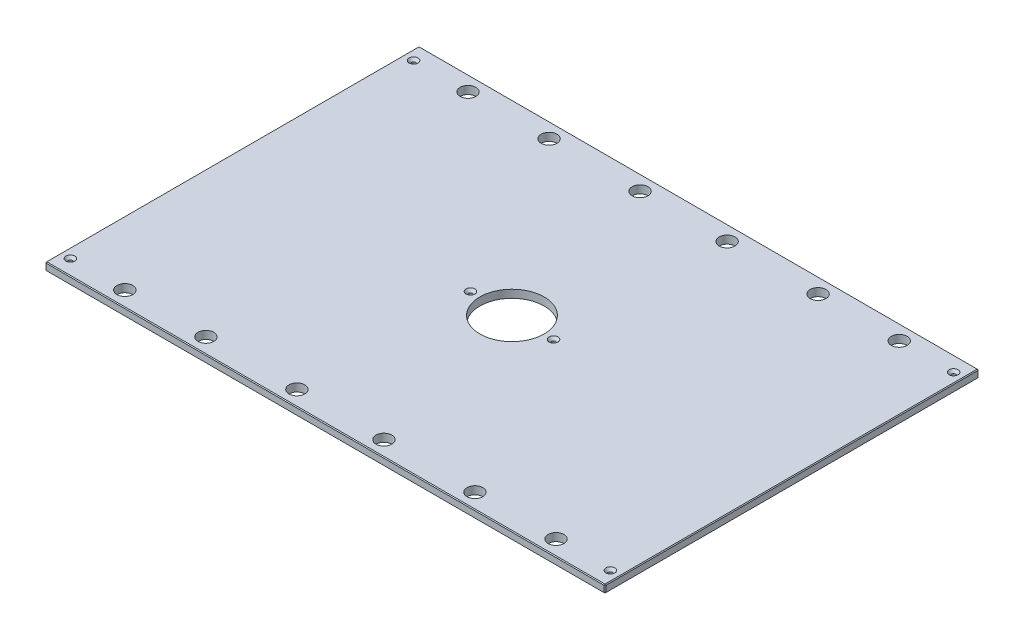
ISO-10303-21;
HEADER;
FILE_DESCRIPTION(('STEP AP214'),'2;1');
FILE_NAME('part.step','',(''),(''),'','','');
FILE_SCHEMA(('AUTOMOTIVE_DESIGN { 1 0 10303 214 1 1 1 1 }'));
ENDSEC;
DATA;
#1=APPLICATION_CONTEXT('core data for automotive mechanical design processes');
#2=APPLICATION_PROTOCOL_DEFINITION('international standard','automotive_design',2000,#1);
#3=PRODUCT_CONTEXT('',#1,'mechanical');
#4=PRODUCT('Part','Part','',(#3));
#5=PRODUCT_RELATED_PRODUCT_CATEGORY('part','',(#4));
#6=PRODUCT_DEFINITION_FORMATION('','',#4);
#7=PRODUCT_DEFINITION_CONTEXT('part definition',#1,'design');
#8=PRODUCT_DEFINITION('design','',#6,#7);
#9=PRODUCT_DEFINITION_SHAPE('','',#8);
#10=(LENGTH_UNIT() NAMED_UNIT(*) SI_UNIT(.MILLI.,.METRE.));
#11=(NAMED_UNIT(*) PLANE_ANGLE_UNIT() SI_UNIT($,.RADIAN.));
#12=(NAMED_UNIT(*) SI_UNIT($,.STERADIAN.) SOLID_ANGLE_UNIT());
#13=UNCERTAINTY_MEASURE_WITH_UNIT(LENGTH_MEASURE(1.E-05),#10,'distance_accuracy_value','');
#14=(GEOMETRIC_REPRESENTATION_CONTEXT(3) GLOBAL_UNCERTAINTY_ASSIGNED_CONTEXT((#13)) GLOBAL_UNIT_ASSIGNED_CONTEXT((#10,
#11,#12)) REPRESENTATION_CONTEXT('',''));
#15=CARTESIAN_POINT('',(0.,0.,0.));
#16=DIRECTION('',(0.,0.,1.));
#17=DIRECTION('',(1.,0.,0.));
#18=AXIS2_PLACEMENT_3D('',#15,#16,#17);
#19=CARTESIAN_POINT('',(-449.2625,12.7,-300.0375));
#20=DIRECTION('',(1.,0.,0.));
#21=DIRECTION('',(0.,0.,-1.));
#22=AXIS2_PLACEMENT_3D('',#19,#20,#21);
#23=PLANE('',#22);
#24=DIRECTION('',(0.,0.,-1.));
#25=VECTOR('',#24,1.);
#26=CARTESIAN_POINT('',(-449.2625,11.43,-300.0375));
#27=LINE('',#26,#25);
#28=CARTESIAN_POINT('',(-449.2625,11.43,298.7675));
#29=VERTEX_POINT('',#28);
#30=CARTESIAN_POINT('',(-449.2625,11.43,-298.7675));
#31=VERTEX_POINT('',#30);
#32=EDGE_CURVE('E136',#29,#31,#27,.T.);
#33=ORIENTED_EDGE('',*,*,#32,.T.);
#34=DIRECTION('',(0.,-1.,0.));
#35=VECTOR('',#34,1.);
#36=CARTESIAN_POINT('',(-449.2625,12.7,-298.7675));
#37=LINE('',#36,#35);
#38=CARTESIAN_POINT('',(-449.2625,1.26999999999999,-298.7675));
#39=VERTEX_POINT('',#38);
#40=EDGE_CURVE('E132',#31,#39,#37,.T.);
#41=ORIENTED_EDGE('',*,*,#40,.T.);
#42=DIRECTION('',(0.,0.,1.));
#43=VECTOR('',#42,1.);
#44=CARTESIAN_POINT('',(-449.2625,1.26999999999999,-300.0375));
#45=LINE('',#44,#43);
#46=CARTESIAN_POINT('',(-449.2625,1.26999999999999,298.7675));
#47=VERTEX_POINT('',#46);
#48=EDGE_CURVE('E127',#39,#47,#45,.T.);
#49=ORIENTED_EDGE('',*,*,#48,.T.);
#50=DIRECTION('',(0.,1.,0.));
#51=VECTOR('',#50,1.);
#52=CARTESIAN_POINT('',(-449.2625,12.7,298.7675));
#53=LINE('',#52,#51);
#54=EDGE_CURVE('E129',#47,#29,#53,.T.);
#55=ORIENTED_EDGE('',*,*,#54,.T.);
#56=EDGE_LOOP('',(#33,#41,#49,#55));
#57=FACE_BOUND('',#56,.T.);
#58=ADVANCED_FACE('F36',(#57),#23,.F.);
#59=CARTESIAN_POINT('',(-449.2625,12.7,300.0375));
#60=DIRECTION('',(0.,0.,-1.));
#61=DIRECTION('',(-1.,0.,0.));
#62=AXIS2_PLACEMENT_3D('',#59,#60,#61);
#63=PLANE('',#62);
#64=DIRECTION('',(1.,0.,0.));
#65=VECTOR('',#64,1.);
#66=CARTESIAN_POINT('',(-449.2625,1.26999999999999,300.0375));
#67=LINE('',#66,#65);
#68=CARTESIAN_POINT('',(-447.9925,1.26999999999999,300.0375));
#69=VERTEX_POINT('',#68);
#70=CARTESIAN_POINT('',(447.9925,1.26999999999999,300.0375));
#71=VERTEX_POINT('',#70);
#72=EDGE_CURVE('E59',#69,#71,#67,.T.);
#73=ORIENTED_EDGE('',*,*,#72,.T.);
#74=DIRECTION('',(0.,1.,0.));
#75=VECTOR('',#74,1.);
#76=CARTESIAN_POINT('',(447.9925,12.7,300.0375));
#77=LINE('',#76,#75);
#78=CARTESIAN_POINT('',(447.9925,11.43,300.0375));
#79=VERTEX_POINT('',#78);
#80=EDGE_CURVE('E11',#71,#79,#77,.T.);
#81=ORIENTED_EDGE('',*,*,#80,.T.);
#82=DIRECTION('',(-1.,0.,0.));
#83=VECTOR('',#82,1.);
#84=CARTESIAN_POINT('',(-449.2625,11.43,300.0375));
#85=LINE('',#84,#83);
#86=CARTESIAN_POINT('',(-447.9925,11.43,300.0375));
#87=VERTEX_POINT('',#86);
#88=EDGE_CURVE('E45',#79,#87,#85,.T.);
#89=ORIENTED_EDGE('',*,*,#88,.T.);
#90=DIRECTION('',(0.,-1.,0.));
#91=VECTOR('',#90,1.);
#92=CARTESIAN_POINT('',(-447.9925,12.7,300.0375));
#93=LINE('',#92,#91);
#94=EDGE_CURVE('E328',#87,#69,#93,.T.);
#95=ORIENTED_EDGE('',*,*,#94,.T.);
#96=EDGE_LOOP('',(#73,#81,#89,#95));
#97=FACE_BOUND('',#96,.T.);
#98=ADVANCED_FACE('F397',(#97),#63,.F.);
#99=CARTESIAN_POINT('',(449.2625,12.7,-300.0375));
#100=DIRECTION('',(-1.,0.,0.));
#101=DIRECTION('',(0.,0.,1.));
#102=AXIS2_PLACEMENT_3D('',#99,#100,#101);
#103=PLANE('',#102);
#104=DIRECTION('',(0.,0.,-1.));
#105=VECTOR('',#104,1.);
#106=CARTESIAN_POINT('',(449.2625,1.26999999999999,-300.0375));
#107=LINE('',#106,#105);
#108=CARTESIAN_POINT('',(449.2625,1.26999999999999,298.7675));
#109=VERTEX_POINT('',#108);
#110=CARTESIAN_POINT('',(449.2625,1.26999999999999,-298.7675));
#111=VERTEX_POINT('',#110);
#112=EDGE_CURVE('E323',#109,#111,#107,.T.);
#113=ORIENTED_EDGE('',*,*,#112,.T.);
#114=DIRECTION('',(0.,1.,0.));
#115=VECTOR('',#114,1.);
#116=CARTESIAN_POINT('',(449.2625,12.7,-298.7675));
#117=LINE('',#116,#115);
#118=CARTESIAN_POINT('',(449.2625,11.43,-298.7675));
#119=VERTEX_POINT('',#118);
#120=EDGE_CURVE('E325',#111,#119,#117,.T.);
#121=ORIENTED_EDGE('',*,*,#120,.T.);
#122=DIRECTION('',(0.,0.,1.));
#123=VECTOR('',#122,1.);
#124=CARTESIAN_POINT('',(449.2625,11.43,300.0375));
#125=LINE('',#124,#123);
#126=CARTESIAN_POINT('',(449.2625,11.43,298.7675));
#127=VERTEX_POINT('',#126);
#128=EDGE_CURVE('E321',#119,#127,#125,.T.);
#129=ORIENTED_EDGE('',*,*,#128,.T.);
#130=DIRECTION('',(0.,-1.,0.));
#131=VECTOR('',#130,1.);
#132=CARTESIAN_POINT('',(449.2625,12.7,298.7675));
#133=LINE('',#132,#131);
#134=EDGE_CURVE('E319',#127,#109,#133,.T.);
#135=ORIENTED_EDGE('',*,*,#134,.T.);
#136=EDGE_LOOP('',(#113,#121,#129,#135));
#137=FACE_BOUND('',#136,.T.);
#138=ADVANCED_FACE('F384',(#137),#103,.F.);
#139=CARTESIAN_POINT('',(-449.2625,12.7,-300.0375));
#140=DIRECTION('',(0.,0.,1.));
#141=DIRECTION('',(1.,0.,0.));
#142=AXIS2_PLACEMENT_3D('',#139,#140,#141);
#143=PLANE('',#142);
#144=DIRECTION('',(-1.,0.,0.));
#145=VECTOR('',#144,1.);
#146=CARTESIAN_POINT('',(-449.2625,1.26999999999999,-300.0375));
#147=LINE('',#146,#145);
#148=CARTESIAN_POINT('',(447.9925,1.26999999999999,-300.0375));
#149=VERTEX_POINT('',#148);
#150=CARTESIAN_POINT('',(-447.9925,1.26999999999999,-300.0375));
#151=VERTEX_POINT('',#150);
#152=EDGE_CURVE('E295',#149,#151,#147,.T.);
#153=ORIENTED_EDGE('',*,*,#152,.T.);
#154=DIRECTION('',(0.,1.,0.));
#155=VECTOR('',#154,1.);
#156=CARTESIAN_POINT('',(-447.9925,12.7,-300.0375));
#157=LINE('',#156,#155);
#158=CARTESIAN_POINT('',(-447.9925,11.43,-300.0375));
#159=VERTEX_POINT('',#158);
#160=EDGE_CURVE('E299',#151,#159,#157,.T.);
#161=ORIENTED_EDGE('',*,*,#160,.T.);
#162=DIRECTION('',(1.,0.,0.));
#163=VECTOR('',#162,1.);
#164=CARTESIAN_POINT('',(449.2625,11.43,-300.0375));
#165=LINE('',#164,#163);
#166=CARTESIAN_POINT('',(447.9925,11.43,-300.0375));
#167=VERTEX_POINT('',#166);
#168=EDGE_CURVE('E297',#159,#167,#165,.T.);
#169=ORIENTED_EDGE('',*,*,#168,.T.);
#170=DIRECTION('',(0.,-1.,0.));
#171=VECTOR('',#170,1.);
#172=CARTESIAN_POINT('',(447.9925,12.7,-300.0375));
#173=LINE('',#172,#171);
#174=EDGE_CURVE('E293',#167,#149,#173,.T.);
#175=ORIENTED_EDGE('',*,*,#174,.T.);
#176=EDGE_LOOP('',(#153,#161,#169,#175));
#177=FACE_BOUND('',#176,.T.);
#178=ADVANCED_FACE('F358',(#177),#143,.F.);
#179=CARTESIAN_POINT('',(0.,12.7,0.));
#180=DIRECTION('',(0.,1.,0.));
#181=DIRECTION('',(0.,0.,1.));
#182=AXIS2_PLACEMENT_3D('',#179,#180,#181);
#183=PLANE('',#182);
#184=CARTESIAN_POINT('',(433.3875,12.7,-275.42998));
#185=DIRECTION('',(0.,1.,0.));
#186=DIRECTION('',(0.,0.,1.));
#187=AXIS2_PLACEMENT_3D('',#184,#185,#186);
#188=CIRCLE('',#187,7.13740000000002);
#189=CARTESIAN_POINT('',(433.3875,12.7,-268.29258));
#190=VERTEX_POINT('',#189);
#191=EDGE_CURVE('E881',#190,#190,#188,.T.);
#192=ORIENTED_EDGE('',*,*,#191,.F.);
#193=EDGE_LOOP('',(#192));
#194=FACE_BOUND('',#193,.T.);
#195=CARTESIAN_POINT('',(433.3875,12.7,275.42998));
#196=DIRECTION('',(0.,1.,0.));
#197=DIRECTION('',(0.,0.,1.));
#198=AXIS2_PLACEMENT_3D('',#195,#196,#197);
#199=CIRCLE('',#198,7.13740000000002);
#200=CARTESIAN_POINT('',(433.3875,12.7,282.56738));
#201=VERTEX_POINT('',#200);
#202=EDGE_CURVE('E885',#201,#201,#199,.T.);
#203=ORIENTED_EDGE('',*,*,#202,.F.);
#204=EDGE_LOOP('',(#203));
#205=FACE_BOUND('',#204,.T.);
#206=CARTESIAN_POINT('',(-433.3875,12.7,275.42998));
#207=DIRECTION('',(0.,1.,0.));
#208=DIRECTION('',(0.,0.,1.));
#209=AXIS2_PLACEMENT_3D('',#206,#207,#208);
#210=CIRCLE('',#209,7.13740000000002);
#211=CARTESIAN_POINT('',(-433.3875,12.7,282.56738));
#212=VERTEX_POINT('',#211);
#213=EDGE_CURVE('E889',#212,#212,#210,.T.);
#214=ORIENTED_EDGE('',*,*,#213,.F.);
#215=EDGE_LOOP('',(#214));
#216=FACE_BOUND('',#215,.T.);
#217=CARTESIAN_POINT('',(-66.675,12.7,0.));
#218=DIRECTION('',(0.,1.,0.));
#219=DIRECTION('',(0.,0.,1.));
#220=AXIS2_PLACEMENT_3D('',#217,#218,#219);
#221=CIRCLE('',#220,7.1374);
#222=CARTESIAN_POINT('',(-66.675,12.7,7.1374));
#223=VERTEX_POINT('',#222);
#224=EDGE_CURVE('E893',#223,#223,#221,.T.);
#225=ORIENTED_EDGE('',*,*,#224,.F.);
#226=EDGE_LOOP('',(#225));
#227=FACE_BOUND('',#226,.T.);
#228=CARTESIAN_POINT('',(66.675,12.7,0.));
#229=DIRECTION('',(0.,1.,0.));
#230=DIRECTION('',(0.,0.,1.));
#231=AXIS2_PLACEMENT_3D('',#228,#229,#230);
#232=CIRCLE('',#231,7.1374);
#233=CARTESIAN_POINT('',(66.675,12.7,7.1374));
#234=VERTEX_POINT('',#233);
#235=EDGE_CURVE('E897',#234,#234,#232,.T.);
#236=ORIENTED_EDGE('',*,*,#235,.F.);
#237=EDGE_LOOP('',(#236));
#238=FACE_BOUND('',#237,.T.);
#239=CARTESIAN_POINT('',(-433.3875,12.7,-275.42998));
#240=DIRECTION('',(0.,1.,0.));
#241=DIRECTION('',(0.,0.,1.));
#242=AXIS2_PLACEMENT_3D('',#239,#240,#241);
#243=CIRCLE('',#242,7.13740000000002);
#244=CARTESIAN_POINT('',(-433.3875,12.7,-268.29258));
#245=VERTEX_POINT('',#244);
#246=EDGE_CURVE('E900',#245,#245,#243,.T.);
#247=ORIENTED_EDGE('',*,*,#246,.F.);
#248=EDGE_LOOP('',(#247));
#249=FACE_BOUND('',#248,.T.);
#250=DIRECTION('',(0.,0.,-1.));
#251=VECTOR('',#250,1.);
#252=CARTESIAN_POINT('',(447.9925,12.7,-300.0375));
#253=LINE('',#252,#251);
#254=CARTESIAN_POINT('',(447.9925,12.7,298.7675));
#255=VERTEX_POINT('',#254);
#256=CARTESIAN_POINT('',(447.9925,12.7,-298.7675));
#257=VERTEX_POINT('',#256);
#258=EDGE_CURVE('E306',#255,#257,#253,.T.);
#259=ORIENTED_EDGE('',*,*,#258,.T.);
#260=DIRECTION('',(-1.,0.,0.));
#261=VECTOR('',#260,1.);
#262=CARTESIAN_POINT('',(-449.2625,12.7,-298.7675));
#263=LINE('',#262,#261);
#264=CARTESIAN_POINT('',(-447.9925,12.7,-298.7675));
#265=VERTEX_POINT('',#264);
#266=EDGE_CURVE('E308',#257,#265,#263,.T.);
#267=ORIENTED_EDGE('',*,*,#266,.T.);
#268=DIRECTION('',(0.,0.,1.));
#269=VECTOR('',#268,1.);
#270=CARTESIAN_POINT('',(-447.9925,12.7,300.0375));
#271=LINE('',#270,#269);
#272=CARTESIAN_POINT('',(-447.9925,12.7,298.7675));
#273=VERTEX_POINT('',#272);
#274=EDGE_CURVE('E304',#265,#273,#271,.T.);
#275=ORIENTED_EDGE('',*,*,#274,.T.);
#276=DIRECTION('',(1.,0.,0.));
#277=VECTOR('',#276,1.);
#278=CARTESIAN_POINT('',(449.2625,12.7,298.7675));
#279=LINE('',#278,#277);
#280=EDGE_CURVE('E302',#273,#255,#279,.T.);
#281=ORIENTED_EDGE('',*,*,#280,.T.);
#282=EDGE_LOOP('',(#259,#267,#275,#281));
#283=FACE_BOUND('',#282,.T.);
#284=CARTESIAN_POINT('',(346.075,12.7,-275.42998));
#285=DIRECTION('',(0.,1.,0.));
#286=DIRECTION('',(0.,0.,1.));
#287=AXIS2_PLACEMENT_3D('',#284,#285,#286);
#288=CIRCLE('',#287,12.7);
#289=CARTESIAN_POINT('',(346.075,12.7,-262.72998));
#290=VERTEX_POINT('',#289);
#291=EDGE_CURVE('E205',#290,#290,#288,.T.);
#292=ORIENTED_EDGE('',*,*,#291,.F.);
#293=EDGE_LOOP('',(#292));
#294=FACE_BOUND('',#293,.T.);
#295=CARTESIAN_POINT('',(-346.075,12.7,-275.42998));
#296=DIRECTION('',(0.,1.,0.));
#297=DIRECTION('',(0.,0.,1.));
#298=AXIS2_PLACEMENT_3D('',#295,#296,#297);
#299=CIRCLE('',#298,12.7);
#300=CARTESIAN_POINT('',(-346.075,12.7,-262.72998));
#301=VERTEX_POINT('',#300);
#302=EDGE_CURVE('E215',#301,#301,#299,.T.);
#303=ORIENTED_EDGE('',*,*,#302,.F.);
#304=EDGE_LOOP('',(#303));
#305=FACE_BOUND('',#304,.T.);
#306=CARTESIAN_POINT('',(346.075,12.7,275.42998));
#307=DIRECTION('',(0.,1.,0.));
#308=DIRECTION('',(0.,0.,1.));
#309=AXIS2_PLACEMENT_3D('',#306,#307,#308);
#310=CIRCLE('',#309,12.7);
#311=CARTESIAN_POINT('',(346.075,12.7,288.12998));
#312=VERTEX_POINT('',#311);
#313=EDGE_CURVE('E226',#312,#312,#310,.T.);
#314=ORIENTED_EDGE('',*,*,#313,.F.);
#315=EDGE_LOOP('',(#314));
#316=FACE_BOUND('',#315,.T.);
#317=CARTESIAN_POINT('',(-346.075,12.7,275.42998));
#318=DIRECTION('',(0.,1.,0.));
#319=DIRECTION('',(0.,0.,1.));
#320=AXIS2_PLACEMENT_3D('',#317,#318,#319);
#321=CIRCLE('',#320,12.7);
#322=CARTESIAN_POINT('',(-346.075,12.7,288.12998));
#323=VERTEX_POINT('',#322);
#324=EDGE_CURVE('E232',#323,#323,#321,.T.);
#325=ORIENTED_EDGE('',*,*,#324,.F.);
#326=EDGE_LOOP('',(#325));
#327=FACE_BOUND('',#326,.T.);
#328=CARTESIAN_POINT('',(-215.9,12.7,-275.42998));
#329=DIRECTION('',(0.,1.,0.));
#330=DIRECTION('',(0.,0.,1.));
#331=AXIS2_PLACEMENT_3D('',#328,#329,#330);
#332=CIRCLE('',#331,12.7);
#333=CARTESIAN_POINT('',(-215.9,12.7,-262.72998));
#334=VERTEX_POINT('',#333);
#335=EDGE_CURVE('E238',#334,#334,#332,.T.);
#336=ORIENTED_EDGE('',*,*,#335,.F.);
#337=EDGE_LOOP('',(#336));
#338=FACE_BOUND('',#337,.T.);
#339=CARTESIAN_POINT('',(215.9,12.7,-275.42998));
#340=DIRECTION('',(0.,1.,0.));
#341=DIRECTION('',(0.,0.,1.));
#342=AXIS2_PLACEMENT_3D('',#339,#340,#341);
#343=CIRCLE('',#342,12.7);
#344=CARTESIAN_POINT('',(215.9,12.7,-262.72998));
#345=VERTEX_POINT('',#344);
#346=EDGE_CURVE('E244',#345,#345,#343,.T.);
#347=ORIENTED_EDGE('',*,*,#346,.F.);
#348=EDGE_LOOP('',(#347));
#349=FACE_BOUND('',#348,.T.);
#350=CARTESIAN_POINT('',(215.9,12.7,275.42998));
#351=DIRECTION('',(0.,1.,0.));
#352=DIRECTION('',(0.,0.,1.));
#353=AXIS2_PLACEMENT_3D('',#350,#351,#352);
#354=CIRCLE('',#353,12.7);
#355=CARTESIAN_POINT('',(215.9,12.7,288.12998));
#356=VERTEX_POINT('',#355);
#357=EDGE_CURVE('E250',#356,#356,#354,.T.);
#358=ORIENTED_EDGE('',*,*,#357,.F.);
#359=EDGE_LOOP('',(#358));
#360=FACE_BOUND('',#359,.T.);
#361=CARTESIAN_POINT('',(-215.9,12.7,275.42998));
#362=DIRECTION('',(0.,1.,0.));
#363=DIRECTION('',(0.,0.,1.));
#364=AXIS2_PLACEMENT_3D('',#361,#362,#363);
#365=CIRCLE('',#364,12.7);
#366=CARTESIAN_POINT('',(-215.9,12.7,288.12998));
#367=VERTEX_POINT('',#366);
#368=EDGE_CURVE('E256',#367,#367,#365,.T.);
#369=ORIENTED_EDGE('',*,*,#368,.F.);
#370=EDGE_LOOP('',(#369));
#371=FACE_BOUND('',#370,.T.);
#372=CARTESIAN_POINT('',(69.85,12.7,-275.42998));
#373=DIRECTION('',(0.,1.,0.));
#374=DIRECTION('',(0.,0.,1.));
#375=AXIS2_PLACEMENT_3D('',#372,#373,#374);
#376=CIRCLE('',#375,12.7);
#377=CARTESIAN_POINT('',(69.85,12.7,-262.72998));
#378=VERTEX_POINT('',#377);
#379=EDGE_CURVE('E262',#378,#378,#376,.T.);
#380=ORIENTED_EDGE('',*,*,#379,.F.);
#381=EDGE_LOOP('',(#380));
#382=FACE_BOUND('',#381,.T.);
#383=CARTESIAN_POINT('',(-69.85,12.7,-275.42998));
#384=DIRECTION('',(0.,1.,0.));
#385=DIRECTION('',(0.,0.,1.));
#386=AXIS2_PLACEMENT_3D('',#383,#384,#385);
#387=CIRCLE('',#386,12.7);
#388=CARTESIAN_POINT('',(-69.85,12.7,-262.72998));
#389=VERTEX_POINT('',#388);
#390=EDGE_CURVE('E268',#389,#389,#387,.T.);
#391=ORIENTED_EDGE('',*,*,#390,.F.);
#392=EDGE_LOOP('',(#391));
#393=FACE_BOUND('',#392,.T.);
#394=CARTESIAN_POINT('',(-69.85,12.7,275.42998));
#395=DIRECTION('',(0.,1.,0.));
#396=DIRECTION('',(0.,0.,1.));
#397=AXIS2_PLACEMENT_3D('',#394,#395,#396);
#398=CIRCLE('',#397,12.7);
#399=CARTESIAN_POINT('',(-69.85,12.7,288.12998));
#400=VERTEX_POINT('',#399);
#401=EDGE_CURVE('E274',#400,#400,#398,.T.);
#402=ORIENTED_EDGE('',*,*,#401,.F.);
#403=EDGE_LOOP('',(#402));
#404=FACE_BOUND('',#403,.T.);
#405=CARTESIAN_POINT('',(69.85,12.7,275.42998));
#406=DIRECTION('',(0.,1.,0.));
#407=DIRECTION('',(0.,0.,1.));
#408=AXIS2_PLACEMENT_3D('',#405,#406,#407);
#409=CIRCLE('',#408,12.7);
#410=CARTESIAN_POINT('',(69.85,12.7,288.12998));
#411=VERTEX_POINT('',#410);
#412=EDGE_CURVE('E280',#411,#411,#409,.T.);
#413=ORIENTED_EDGE('',*,*,#412,.F.);
#414=EDGE_LOOP('',(#413));
#415=FACE_BOUND('',#414,.T.);
#416=CARTESIAN_POINT('',(0.,12.7,0.));
#417=DIRECTION('',(0.,1.,0.));
#418=DIRECTION('',(0.,0.,1.));
#419=AXIS2_PLACEMENT_3D('',#416,#417,#418);
#420=CIRCLE('',#419,51.562);
#421=CARTESIAN_POINT('',(0.,12.7,51.562));
#422=VERTEX_POINT('',#421);
#423=EDGE_CURVE('E286',#422,#422,#420,.T.);
#424=ORIENTED_EDGE('',*,*,#423,.F.);
#425=EDGE_LOOP('',(#424));
#426=FACE_BOUND('',#425,.T.);
#427=ADVANCED_FACE('F406',(#194,#205,#216,#227,#238,#249,#283,#294,#305,#316,#327,#338,#349,
#360,#371,#382,#393,#404,#415,#426),#183,.T.);
#428=CARTESIAN_POINT('',(0.,0.,0.));
#429=DIRECTION('',(0.,1.,0.));
#430=DIRECTION('',(0.,0.,1.));
#431=AXIS2_PLACEMENT_3D('',#428,#429,#430);
#432=PLANE('',#431);
#433=CARTESIAN_POINT('',(433.3875,0.,-275.42998));
#434=DIRECTION('',(0.,1.,0.));
#435=DIRECTION('',(0.,0.,1.));
#436=AXIS2_PLACEMENT_3D('',#433,#434,#435);
#437=CIRCLE('',#436,3.3782);
#438=CARTESIAN_POINT('',(433.3875,0.,-272.05178));
#439=VERTEX_POINT('',#438);
#440=EDGE_CURVE('E934',#439,#439,#437,.T.);
#441=ORIENTED_EDGE('',*,*,#440,.T.);
#442=EDGE_LOOP('',(#441));
#443=FACE_BOUND('',#442,.T.);
#444=CARTESIAN_POINT('',(433.3875,0.,275.42998));
#445=DIRECTION('',(0.,1.,0.));
#446=DIRECTION('',(0.,0.,1.));
#447=AXIS2_PLACEMENT_3D('',#444,#445,#446);
#448=CIRCLE('',#447,3.3782);
#449=CARTESIAN_POINT('',(433.3875,0.,278.80818));
#450=VERTEX_POINT('',#449);
#451=EDGE_CURVE('E927',#450,#450,#448,.T.);
#452=ORIENTED_EDGE('',*,*,#451,.T.);
#453=EDGE_LOOP('',(#452));
#454=FACE_BOUND('',#453,.T.);
#455=CARTESIAN_POINT('',(-433.3875,0.,275.42998));
#456=DIRECTION('',(0.,1.,0.));
#457=DIRECTION('',(0.,0.,1.));
#458=AXIS2_PLACEMENT_3D('',#455,#456,#457);
#459=CIRCLE('',#458,3.3782);
#460=CARTESIAN_POINT('',(-433.3875,0.,278.80818));
#461=VERTEX_POINT('',#460);
#462=EDGE_CURVE('E920',#461,#461,#459,.T.);
#463=ORIENTED_EDGE('',*,*,#462,.T.);
#464=EDGE_LOOP('',(#463));
#465=FACE_BOUND('',#464,.T.);
#466=CARTESIAN_POINT('',(-66.675,0.,0.));
#467=DIRECTION('',(0.,1.,0.));
#468=DIRECTION('',(0.,0.,1.));
#469=AXIS2_PLACEMENT_3D('',#466,#467,#468);
#470=CIRCLE('',#469,3.3782);
#471=CARTESIAN_POINT('',(-66.675,0.,3.3782));
#472=VERTEX_POINT('',#471);
#473=EDGE_CURVE('E913',#472,#472,#470,.T.);
#474=ORIENTED_EDGE('',*,*,#473,.T.);
#475=EDGE_LOOP('',(#474));
#476=FACE_BOUND('',#475,.T.);
#477=CARTESIAN_POINT('',(66.675,0.,0.));
#478=DIRECTION('',(0.,1.,0.));
#479=DIRECTION('',(0.,0.,1.));
#480=AXIS2_PLACEMENT_3D('',#477,#478,#479);
#481=CIRCLE('',#480,3.3782);
#482=CARTESIAN_POINT('',(66.675,0.,3.3782));
#483=VERTEX_POINT('',#482);
#484=EDGE_CURVE('E903',#483,#483,#481,.T.);
#485=ORIENTED_EDGE('',*,*,#484,.T.);
#486=EDGE_LOOP('',(#485));
#487=FACE_BOUND('',#486,.T.);
#488=CARTESIAN_POINT('',(-433.3875,0.,-275.42998));
#489=DIRECTION('',(0.,1.,0.));
#490=DIRECTION('',(0.,0.,1.));
#491=AXIS2_PLACEMENT_3D('',#488,#489,#490);
#492=CIRCLE('',#491,3.3782);
#493=CARTESIAN_POINT('',(-433.3875,0.,-272.05178));
#494=VERTEX_POINT('',#493);
#495=EDGE_CURVE('E218',#494,#494,#492,.T.);
#496=ORIENTED_EDGE('',*,*,#495,.T.);
#497=EDGE_LOOP('',(#496));
#498=FACE_BOUND('',#497,.T.);
#499=DIRECTION('',(0.,0.,-1.));
#500=VECTOR('',#499,1.);
#501=CARTESIAN_POINT('',(-447.9925,0.,0.));
#502=LINE('',#501,#500);
#503=CARTESIAN_POINT('',(-447.9925,0.,298.7675));
#504=VERTEX_POINT('',#503);
#505=CARTESIAN_POINT('',(-447.9925,0.,-298.7675));
#506=VERTEX_POINT('',#505);
#507=EDGE_CURVE('E159',#504,#506,#502,.T.);
#508=ORIENTED_EDGE('',*,*,#507,.T.);
#509=DIRECTION('',(1.,0.,0.));
#510=VECTOR('',#509,1.);
#511=CARTESIAN_POINT('',(0.,0.,-298.7675));
#512=LINE('',#511,#510);
#513=CARTESIAN_POINT('',(447.9925,0.,-298.7675));
#514=VERTEX_POINT('',#513);
#515=EDGE_CURVE('E316',#506,#514,#512,.T.);
#516=ORIENTED_EDGE('',*,*,#515,.T.);
#517=DIRECTION('',(0.,0.,1.));
#518=VECTOR('',#517,1.);
#519=CARTESIAN_POINT('',(447.9925,0.,0.));
#520=LINE('',#519,#518);
#521=CARTESIAN_POINT('',(447.9925,0.,298.7675));
#522=VERTEX_POINT('',#521);
#523=EDGE_CURVE('E314',#514,#522,#520,.T.);
#524=ORIENTED_EDGE('',*,*,#523,.T.);
#525=DIRECTION('',(-1.,0.,0.));
#526=VECTOR('',#525,1.);
#527=CARTESIAN_POINT('',(0.,0.,298.7675));
#528=LINE('',#527,#526);
#529=EDGE_CURVE('E311',#522,#504,#528,.T.);
#530=ORIENTED_EDGE('',*,*,#529,.T.);
#531=EDGE_LOOP('',(#508,#516,#524,#530));
#532=FACE_BOUND('',#531,.T.);
#533=CARTESIAN_POINT('',(346.075,0.,-275.42998));
#534=DIRECTION('',(0.,1.,0.));
#535=DIRECTION('',(0.,0.,1.));
#536=AXIS2_PLACEMENT_3D('',#533,#534,#535);
#537=CIRCLE('',#536,12.7);
#538=CARTESIAN_POINT('',(346.075,0.,-262.72998));
#539=VERTEX_POINT('',#538);
#540=EDGE_CURVE('E210',#539,#539,#537,.T.);
#541=ORIENTED_EDGE('',*,*,#540,.T.);
#542=EDGE_LOOP('',(#541));
#543=FACE_BOUND('',#542,.T.);
#544=CARTESIAN_POINT('',(-346.075,0.,-275.42998));
#545=DIRECTION('',(0.,1.,0.));
#546=DIRECTION('',(0.,0.,1.));
#547=AXIS2_PLACEMENT_3D('',#544,#545,#546);
#548=CIRCLE('',#547,12.7);
#549=CARTESIAN_POINT('',(-346.075,0.,-262.72998));
#550=VERTEX_POINT('',#549);
#551=EDGE_CURVE('E223',#550,#550,#548,.T.);
#552=ORIENTED_EDGE('',*,*,#551,.T.);
#553=EDGE_LOOP('',(#552));
#554=FACE_BOUND('',#553,.T.);
#555=CARTESIAN_POINT('',(346.075,0.,275.42998));
#556=DIRECTION('',(0.,1.,0.));
#557=DIRECTION('',(0.,0.,1.));
#558=AXIS2_PLACEMENT_3D('',#555,#556,#557);
#559=CIRCLE('',#558,12.7);
#560=CARTESIAN_POINT('',(346.075,0.,288.12998));
#561=VERTEX_POINT('',#560);
#562=EDGE_CURVE('E229',#561,#561,#559,.T.);
#563=ORIENTED_EDGE('',*,*,#562,.T.);
#564=EDGE_LOOP('',(#563));
#565=FACE_BOUND('',#564,.T.);
#566=CARTESIAN_POINT('',(-346.075,0.,275.42998));
#567=DIRECTION('',(0.,1.,0.));
#568=DIRECTION('',(0.,0.,1.));
#569=AXIS2_PLACEMENT_3D('',#566,#567,#568);
#570=CIRCLE('',#569,12.7);
#571=CARTESIAN_POINT('',(-346.075,0.,288.12998));
#572=VERTEX_POINT('',#571);
#573=EDGE_CURVE('E235',#572,#572,#570,.T.);
#574=ORIENTED_EDGE('',*,*,#573,.T.);
#575=EDGE_LOOP('',(#574));
#576=FACE_BOUND('',#575,.T.);
#577=CARTESIAN_POINT('',(-215.9,0.,-275.42998));
#578=DIRECTION('',(0.,1.,0.));
#579=DIRECTION('',(0.,0.,1.));
#580=AXIS2_PLACEMENT_3D('',#577,#578,#579);
#581=CIRCLE('',#580,12.7);
#582=CARTESIAN_POINT('',(-215.9,0.,-262.72998));
#583=VERTEX_POINT('',#582);
#584=EDGE_CURVE('E241',#583,#583,#581,.T.);
#585=ORIENTED_EDGE('',*,*,#584,.T.);
#586=EDGE_LOOP('',(#585));
#587=FACE_BOUND('',#586,.T.);
#588=CARTESIAN_POINT('',(215.9,0.,-275.42998));
#589=DIRECTION('',(0.,1.,0.));
#590=DIRECTION('',(0.,0.,1.));
#591=AXIS2_PLACEMENT_3D('',#588,#589,#590);
#592=CIRCLE('',#591,12.7);
#593=CARTESIAN_POINT('',(215.9,0.,-262.72998));
#594=VERTEX_POINT('',#593);
#595=EDGE_CURVE('E247',#594,#594,#592,.T.);
#596=ORIENTED_EDGE('',*,*,#595,.T.);
#597=EDGE_LOOP('',(#596));
#598=FACE_BOUND('',#597,.T.);
#599=CARTESIAN_POINT('',(215.9,0.,275.42998));
#600=DIRECTION('',(0.,1.,0.));
#601=DIRECTION('',(0.,0.,1.));
#602=AXIS2_PLACEMENT_3D('',#599,#600,#601);
#603=CIRCLE('',#602,12.7);
#604=CARTESIAN_POINT('',(215.9,0.,288.12998));
#605=VERTEX_POINT('',#604);
#606=EDGE_CURVE('E253',#605,#605,#603,.T.);
#607=ORIENTED_EDGE('',*,*,#606,.T.);
#608=EDGE_LOOP('',(#607));
#609=FACE_BOUND('',#608,.T.);
#610=CARTESIAN_POINT('',(-215.9,0.,275.42998));
#611=DIRECTION('',(0.,1.,0.));
#612=DIRECTION('',(0.,0.,1.));
#613=AXIS2_PLACEMENT_3D('',#610,#611,#612);
#614=CIRCLE('',#613,12.7);
#615=CARTESIAN_POINT('',(-215.9,0.,288.12998));
#616=VERTEX_POINT('',#615);
#617=EDGE_CURVE('E259',#616,#616,#614,.T.);
#618=ORIENTED_EDGE('',*,*,#617,.T.);
#619=EDGE_LOOP('',(#618));
#620=FACE_BOUND('',#619,.T.);
#621=CARTESIAN_POINT('',(69.85,0.,-275.42998));
#622=DIRECTION('',(0.,1.,0.));
#623=DIRECTION('',(0.,0.,1.));
#624=AXIS2_PLACEMENT_3D('',#621,#622,#623);
#625=CIRCLE('',#624,12.7);
#626=CARTESIAN_POINT('',(69.85,0.,-262.72998));
#627=VERTEX_POINT('',#626);
#628=EDGE_CURVE('E265',#627,#627,#625,.T.);
#629=ORIENTED_EDGE('',*,*,#628,.T.);
#630=EDGE_LOOP('',(#629));
#631=FACE_BOUND('',#630,.T.);
#632=CARTESIAN_POINT('',(-69.85,0.,-275.42998));
#633=DIRECTION('',(0.,1.,0.));
#634=DIRECTION('',(0.,0.,1.));
#635=AXIS2_PLACEMENT_3D('',#632,#633,#634);
#636=CIRCLE('',#635,12.7);
#637=CARTESIAN_POINT('',(-69.85,0.,-262.72998));
#638=VERTEX_POINT('',#637);
#639=EDGE_CURVE('E271',#638,#638,#636,.T.);
#640=ORIENTED_EDGE('',*,*,#639,.T.);
#641=EDGE_LOOP('',(#640));
#642=FACE_BOUND('',#641,.T.);
#643=CARTESIAN_POINT('',(-69.85,0.,275.42998));
#644=DIRECTION('',(0.,1.,0.));
#645=DIRECTION('',(0.,0.,1.));
#646=AXIS2_PLACEMENT_3D('',#643,#644,#645);
#647=CIRCLE('',#646,12.7);
#648=CARTESIAN_POINT('',(-69.85,0.,288.12998));
#649=VERTEX_POINT('',#648);
#650=EDGE_CURVE('E277',#649,#649,#647,.T.);
#651=ORIENTED_EDGE('',*,*,#650,.T.);
#652=EDGE_LOOP('',(#651));
#653=FACE_BOUND('',#652,.T.);
#654=CARTESIAN_POINT('',(69.85,0.,275.42998));
#655=DIRECTION('',(0.,1.,0.));
#656=DIRECTION('',(0.,0.,1.));
#657=AXIS2_PLACEMENT_3D('',#654,#655,#656);
#658=CIRCLE('',#657,12.7);
#659=CARTESIAN_POINT('',(69.85,0.,288.12998));
#660=VERTEX_POINT('',#659);
#661=EDGE_CURVE('E283',#660,#660,#658,.T.);
#662=ORIENTED_EDGE('',*,*,#661,.T.);
#663=EDGE_LOOP('',(#662));
#664=FACE_BOUND('',#663,.T.);
#665=CARTESIAN_POINT('',(0.,0.,0.));
#666=DIRECTION('',(0.,1.,0.));
#667=DIRECTION('',(0.,0.,1.));
#668=AXIS2_PLACEMENT_3D('',#665,#666,#667);
#669=CIRCLE('',#668,51.562);
#670=CARTESIAN_POINT('',(0.,0.,51.562));
#671=VERTEX_POINT('',#670);
#672=EDGE_CURVE('E148',#671,#671,#669,.T.);
#673=ORIENTED_EDGE('',*,*,#672,.T.);
#674=EDGE_LOOP('',(#673));
#675=FACE_BOUND('',#674,.T.);
#676=ADVANCED_FACE('F371',(#443,#454,#465,#476,#487,#498,#532,#543,#554,#565,#576,#587,#598,
#609,#620,#631,#642,#653,#664,#675),#432,.F.);
#677=CARTESIAN_POINT('',(0.,0.,0.));
#678=DIRECTION('',(0.,1.,0.));
#679=DIRECTION('',(0.,0.,1.));
#680=AXIS2_PLACEMENT_3D('',#677,#678,#679);
#681=CYLINDRICAL_SURFACE('',#680,51.562);
#682=ORIENTED_EDGE('',*,*,#672,.F.);
#683=EDGE_LOOP('',(#682));
#684=FACE_BOUND('',#683,.T.);
#685=ORIENTED_EDGE('',*,*,#423,.T.);
#686=EDGE_LOOP('',(#685));
#687=FACE_BOUND('',#686,.T.);
#688=ADVANCED_FACE('F812',(#684,#687),#681,.F.);
#689=CARTESIAN_POINT('',(69.85,12.7,275.42998));
#690=DIRECTION('',(0.,1.,0.));
#691=DIRECTION('',(0.,0.,1.));
#692=AXIS2_PLACEMENT_3D('',#689,#690,#691);
#693=CYLINDRICAL_SURFACE('',#692,12.7);
#694=ORIENTED_EDGE('',*,*,#661,.F.);
#695=EDGE_LOOP('',(#694));
#696=FACE_BOUND('',#695,.T.);
#697=ORIENTED_EDGE('',*,*,#412,.T.);
#698=EDGE_LOOP('',(#697));
#699=FACE_BOUND('',#698,.T.);
#700=ADVANCED_FACE('F803',(#696,#699),#693,.F.);
#701=CARTESIAN_POINT('',(-69.85,12.7,275.42998));
#702=DIRECTION('',(0.,1.,0.));
#703=DIRECTION('',(0.,0.,1.));
#704=AXIS2_PLACEMENT_3D('',#701,#702,#703);
#705=CYLINDRICAL_SURFACE('',#704,12.7);
#706=ORIENTED_EDGE('',*,*,#650,.F.);
#707=EDGE_LOOP('',(#706));
#708=FACE_BOUND('',#707,.T.);
#709=ORIENTED_EDGE('',*,*,#401,.T.);
#710=EDGE_LOOP('',(#709));
#711=FACE_BOUND('',#710,.T.);
#712=ADVANCED_FACE('F794',(#708,#711),#705,.F.);
#713=CARTESIAN_POINT('',(-69.85,12.7,-275.42998));
#714=DIRECTION('',(0.,1.,0.));
#715=DIRECTION('',(0.,0.,1.));
#716=AXIS2_PLACEMENT_3D('',#713,#714,#715);
#717=CYLINDRICAL_SURFACE('',#716,12.7);
#718=ORIENTED_EDGE('',*,*,#639,.F.);
#719=EDGE_LOOP('',(#718));
#720=FACE_BOUND('',#719,.T.);
#721=ORIENTED_EDGE('',*,*,#390,.T.);
#722=EDGE_LOOP('',(#721));
#723=FACE_BOUND('',#722,.T.);
#724=ADVANCED_FACE('F785',(#720,#723),#717,.F.);
#725=CARTESIAN_POINT('',(69.85,12.7,-275.42998));
#726=DIRECTION('',(0.,1.,0.));
#727=DIRECTION('',(0.,0.,1.));
#728=AXIS2_PLACEMENT_3D('',#725,#726,#727);
#729=CYLINDRICAL_SURFACE('',#728,12.7);
#730=ORIENTED_EDGE('',*,*,#628,.F.);
#731=EDGE_LOOP('',(#730));
#732=FACE_BOUND('',#731,.T.);
#733=ORIENTED_EDGE('',*,*,#379,.T.);
#734=EDGE_LOOP('',(#733));
#735=FACE_BOUND('',#734,.T.);
#736=ADVANCED_FACE('F776',(#732,#735),#729,.F.);
#737=CARTESIAN_POINT('',(-215.9,12.7,275.42998));
#738=DIRECTION('',(0.,1.,0.));
#739=DIRECTION('',(0.,0.,1.));
#740=AXIS2_PLACEMENT_3D('',#737,#738,#739);
#741=CYLINDRICAL_SURFACE('',#740,12.7);
#742=ORIENTED_EDGE('',*,*,#617,.F.);
#743=EDGE_LOOP('',(#742));
#744=FACE_BOUND('',#743,.T.);
#745=ORIENTED_EDGE('',*,*,#368,.T.);
#746=EDGE_LOOP('',(#745));
#747=FACE_BOUND('',#746,.T.);
#748=ADVANCED_FACE('F767',(#744,#747),#741,.F.);
#749=CARTESIAN_POINT('',(215.9,12.7,275.42998));
#750=DIRECTION('',(0.,1.,0.));
#751=DIRECTION('',(0.,0.,1.));
#752=AXIS2_PLACEMENT_3D('',#749,#750,#751);
#753=CYLINDRICAL_SURFACE('',#752,12.7);
#754=ORIENTED_EDGE('',*,*,#606,.F.);
#755=EDGE_LOOP('',(#754));
#756=FACE_BOUND('',#755,.T.);
#757=ORIENTED_EDGE('',*,*,#357,.T.);
#758=EDGE_LOOP('',(#757));
#759=FACE_BOUND('',#758,.T.);
#760=ADVANCED_FACE('F758',(#756,#759),#753,.F.);
#761=CARTESIAN_POINT('',(215.9,12.7,-275.42998));
#762=DIRECTION('',(0.,1.,0.));
#763=DIRECTION('',(0.,0.,1.));
#764=AXIS2_PLACEMENT_3D('',#761,#762,#763);
#765=CYLINDRICAL_SURFACE('',#764,12.7);
#766=ORIENTED_EDGE('',*,*,#595,.F.);
#767=EDGE_LOOP('',(#766));
#768=FACE_BOUND('',#767,.T.);
#769=ORIENTED_EDGE('',*,*,#346,.T.);
#770=EDGE_LOOP('',(#769));
#771=FACE_BOUND('',#770,.T.);
#772=ADVANCED_FACE('F749',(#768,#771),#765,.F.);
#773=CARTESIAN_POINT('',(-215.9,12.7,-275.42998));
#774=DIRECTION('',(0.,1.,0.));
#775=DIRECTION('',(0.,0.,1.));
#776=AXIS2_PLACEMENT_3D('',#773,#774,#775);
#777=CYLINDRICAL_SURFACE('',#776,12.7);
#778=ORIENTED_EDGE('',*,*,#584,.F.);
#779=EDGE_LOOP('',(#778));
#780=FACE_BOUND('',#779,.T.);
#781=ORIENTED_EDGE('',*,*,#335,.T.);
#782=EDGE_LOOP('',(#781));
#783=FACE_BOUND('',#782,.T.);
#784=ADVANCED_FACE('F740',(#780,#783),#777,.F.);
#785=CARTESIAN_POINT('',(-346.075,12.7,275.42998));
#786=DIRECTION('',(0.,1.,0.));
#787=DIRECTION('',(0.,0.,1.));
#788=AXIS2_PLACEMENT_3D('',#785,#786,#787);
#789=CYLINDRICAL_SURFACE('',#788,12.7);
#790=ORIENTED_EDGE('',*,*,#573,.F.);
#791=EDGE_LOOP('',(#790));
#792=FACE_BOUND('',#791,.T.);
#793=ORIENTED_EDGE('',*,*,#324,.T.);
#794=EDGE_LOOP('',(#793));
#795=FACE_BOUND('',#794,.T.);
#796=ADVANCED_FACE('F731',(#792,#795),#789,.F.);
#797=CARTESIAN_POINT('',(346.075,12.7,275.42998));
#798=DIRECTION('',(0.,1.,0.));
#799=DIRECTION('',(0.,0.,1.));
#800=AXIS2_PLACEMENT_3D('',#797,#798,#799);
#801=CYLINDRICAL_SURFACE('',#800,12.7);
#802=ORIENTED_EDGE('',*,*,#562,.F.);
#803=EDGE_LOOP('',(#802));
#804=FACE_BOUND('',#803,.T.);
#805=ORIENTED_EDGE('',*,*,#313,.T.);
#806=EDGE_LOOP('',(#805));
#807=FACE_BOUND('',#806,.T.);
#808=ADVANCED_FACE('F722',(#804,#807),#801,.F.);
#809=CARTESIAN_POINT('',(-346.075,12.7,-275.42998));
#810=DIRECTION('',(0.,1.,0.));
#811=DIRECTION('',(0.,0.,1.));
#812=AXIS2_PLACEMENT_3D('',#809,#810,#811);
#813=CYLINDRICAL_SURFACE('',#812,12.7);
#814=ORIENTED_EDGE('',*,*,#551,.F.);
#815=EDGE_LOOP('',(#814));
#816=FACE_BOUND('',#815,.T.);
#817=ORIENTED_EDGE('',*,*,#302,.T.);
#818=EDGE_LOOP('',(#817));
#819=FACE_BOUND('',#818,.T.);
#820=ADVANCED_FACE('F712',(#816,#819),#813,.F.);
#821=CARTESIAN_POINT('',(346.075,12.7,-275.42998));
#822=DIRECTION('',(0.,1.,0.));
#823=DIRECTION('',(0.,0.,1.));
#824=AXIS2_PLACEMENT_3D('',#821,#822,#823);
#825=CYLINDRICAL_SURFACE('',#824,12.7);
#826=ORIENTED_EDGE('',*,*,#540,.F.);
#827=EDGE_LOOP('',(#826));
#828=FACE_BOUND('',#827,.T.);
#829=ORIENTED_EDGE('',*,*,#291,.T.);
#830=EDGE_LOOP('',(#829));
#831=FACE_BOUND('',#830,.T.);
#832=ADVANCED_FACE('F415',(#828,#831),#825,.F.);
#833=CARTESIAN_POINT('',(449.2625,12.7,298.7675));
#834=DIRECTION('',(-0.707106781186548,0.,-0.707106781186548));
#835=DIRECTION('',(0.,-1.,0.));
#836=AXIS2_PLACEMENT_3D('',#833,#834,#835);
#837=PLANE('',#836);
#838=DIRECTION('',(-0.707106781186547,0.,0.707106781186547));
#839=VECTOR('',#838,1.);
#840=CARTESIAN_POINT('',(449.2625,11.43,298.7675));
#841=LINE('',#840,#839);
#842=EDGE_CURVE('E40',#79,#127,#841,.F.);
#843=ORIENTED_EDGE('',*,*,#842,.F.);
#844=ORIENTED_EDGE('',*,*,#80,.F.);
#845=DIRECTION('',(0.707106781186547,0.,-0.707106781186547));
#846=VECTOR('',#845,1.);
#847=CARTESIAN_POINT('',(448.6275,1.26999999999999,299.4025));
#848=LINE('',#847,#846);
#849=EDGE_CURVE('E198',#109,#71,#848,.F.);
#850=ORIENTED_EDGE('',*,*,#849,.F.);
#851=ORIENTED_EDGE('',*,*,#134,.F.);
#852=EDGE_LOOP('',(#843,#844,#850,#851));
#853=FACE_BOUND('',#852,.T.);
#854=ADVANCED_FACE('F38',(#853),#837,.F.);
#855=CARTESIAN_POINT('',(449.2625,11.43,298.7675));
#856=DIRECTION('',(0.577350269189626,0.577350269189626,0.577350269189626));
#857=DIRECTION('',(0.707106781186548,0.,-0.707106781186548));
#858=AXIS2_PLACEMENT_3D('',#855,#856,#857);
#859=PLANE('',#858);
#860=DIRECTION('',(0.,-0.707106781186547,0.707106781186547));
#861=VECTOR('',#860,1.);
#862=CARTESIAN_POINT('',(447.9925,12.065,299.4025));
#863=LINE('',#862,#861);
#864=EDGE_CURVE('E194',#79,#255,#863,.F.);
#865=ORIENTED_EDGE('',*,*,#864,.F.);
#866=ORIENTED_EDGE('',*,*,#842,.T.);
#867=DIRECTION('',(-0.707106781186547,0.707106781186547,0.));
#868=VECTOR('',#867,1.);
#869=CARTESIAN_POINT('',(449.2625,11.43,298.7675));
#870=LINE('',#869,#868);
#871=EDGE_CURVE('E196',#255,#127,#870,.F.);
#872=ORIENTED_EDGE('',*,*,#871,.F.);
#873=EDGE_LOOP('',(#865,#866,#872));
#874=FACE_BOUND('',#873,.T.);
#875=ADVANCED_FACE('F408',(#874),#859,.T.);
#876=CARTESIAN_POINT('',(447.9925,0.,298.7675));
#877=DIRECTION('',(0.577350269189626,-0.577350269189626,0.577350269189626));
#878=DIRECTION('',(0.707106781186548,0.,-0.707106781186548));
#879=AXIS2_PLACEMENT_3D('',#876,#877,#878);
#880=PLANE('',#879);
#881=DIRECTION('',(-0.707106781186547,-0.707106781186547,0.));
#882=VECTOR('',#881,1.);
#883=CARTESIAN_POINT('',(447.9925,0.,298.7675));
#884=LINE('',#883,#882);
#885=EDGE_CURVE('E188',#109,#522,#884,.T.);
#886=ORIENTED_EDGE('',*,*,#885,.F.);
#887=ORIENTED_EDGE('',*,*,#849,.T.);
#888=DIRECTION('',(0.,0.707106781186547,0.707106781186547));
#889=VECTOR('',#888,1.);
#890=CARTESIAN_POINT('',(447.9925,0.,298.7675));
#891=LINE('',#890,#889);
#892=EDGE_CURVE('E191',#522,#71,#891,.T.);
#893=ORIENTED_EDGE('',*,*,#892,.F.);
#894=EDGE_LOOP('',(#886,#887,#893));
#895=FACE_BOUND('',#894,.T.);
#896=ADVANCED_FACE('F377',(#895),#880,.T.);
#897=CARTESIAN_POINT('',(447.9925,12.7,0.));
#898=DIRECTION('',(0.707106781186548,0.707106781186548,0.));
#899=DIRECTION('',(0.,0.,1.));
#900=AXIS2_PLACEMENT_3D('',#897,#898,#899);
#901=PLANE('',#900);
#902=ORIENTED_EDGE('',*,*,#871,.T.);
#903=ORIENTED_EDGE('',*,*,#128,.F.);
#904=DIRECTION('',(0.707106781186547,-0.707106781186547,0.));
#905=VECTOR('',#904,1.);
#906=CARTESIAN_POINT('',(448.6275,12.065,-298.7675));
#907=LINE('',#906,#905);
#908=EDGE_CURVE('E183',#257,#119,#907,.T.);
#909=ORIENTED_EDGE('',*,*,#908,.F.);
#910=ORIENTED_EDGE('',*,*,#258,.F.);
#911=EDGE_LOOP('',(#902,#903,#909,#910));
#912=FACE_BOUND('',#911,.T.);
#913=ADVANCED_FACE('F394',(#912),#901,.T.);
#914=CARTESIAN_POINT('',(0.,12.7,298.7675));
#915=DIRECTION('',(0.,0.707106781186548,0.707106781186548));
#916=DIRECTION('',(-1.,0.,0.));
#917=AXIS2_PLACEMENT_3D('',#914,#915,#916);
#918=PLANE('',#917);
#919=ORIENTED_EDGE('',*,*,#864,.T.);
#920=ORIENTED_EDGE('',*,*,#280,.F.);
#921=DIRECTION('',(0.,0.707106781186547,-0.707106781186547));
#922=VECTOR('',#921,1.);
#923=CARTESIAN_POINT('',(-447.9925,12.7,298.7675));
#924=LINE('',#923,#922);
#925=EDGE_CURVE('E180',#87,#273,#924,.T.);
#926=ORIENTED_EDGE('',*,*,#925,.F.);
#927=ORIENTED_EDGE('',*,*,#88,.F.);
#928=EDGE_LOOP('',(#919,#920,#926,#927));
#929=FACE_BOUND('',#928,.T.);
#930=ADVANCED_FACE('F399',(#929),#918,.T.);
#931=CARTESIAN_POINT('',(-447.9925,12.7,300.0375));
#932=DIRECTION('',(0.707106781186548,0.,-0.707106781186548));
#933=DIRECTION('',(0.,-1.,0.));
#934=AXIS2_PLACEMENT_3D('',#931,#932,#933);
#935=PLANE('',#934);
#936=DIRECTION('',(0.707106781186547,0.,0.707106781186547));
#937=VECTOR('',#936,1.);
#938=CARTESIAN_POINT('',(-449.2625,1.26999999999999,298.7675));
#939=LINE('',#938,#937);
#940=EDGE_CURVE('E143',#69,#47,#939,.F.);
#941=ORIENTED_EDGE('',*,*,#940,.F.);
#942=ORIENTED_EDGE('',*,*,#94,.F.);
#943=DIRECTION('',(-0.707106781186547,0.,-0.707106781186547));
#944=VECTOR('',#943,1.);
#945=CARTESIAN_POINT('',(-448.6275,11.43,299.4025));
#946=LINE('',#945,#944);
#947=EDGE_CURVE('E146',#29,#87,#946,.F.);
#948=ORIENTED_EDGE('',*,*,#947,.F.);
#949=ORIENTED_EDGE('',*,*,#54,.F.);
#950=EDGE_LOOP('',(#941,#942,#948,#949));
#951=FACE_BOUND('',#950,.T.);
#952=ADVANCED_FACE('F141',(#951),#935,.F.);
#953=CARTESIAN_POINT('',(-449.2625,1.26999999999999,300.0375));
#954=DIRECTION('',(0.,0.707106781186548,-0.707106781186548));
#955=DIRECTION('',(1.,0.,0.));
#956=AXIS2_PLACEMENT_3D('',#953,#954,#955);
#957=PLANE('',#956);
#958=ORIENTED_EDGE('',*,*,#892,.T.);
#959=ORIENTED_EDGE('',*,*,#72,.F.);
#960=DIRECTION('',(0.,-0.707106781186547,-0.707106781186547));
#961=VECTOR('',#960,1.);
#962=CARTESIAN_POINT('',(-447.9925,0.634999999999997,299.4025));
#963=LINE('',#962,#961);
#964=EDGE_CURVE('E156',#504,#69,#963,.F.);
#965=ORIENTED_EDGE('',*,*,#964,.F.);
#966=ORIENTED_EDGE('',*,*,#529,.F.);
#967=EDGE_LOOP('',(#958,#959,#965,#966));
#968=FACE_BOUND('',#967,.T.);
#969=ADVANCED_FACE('F376',(#968),#957,.F.);
#970=CARTESIAN_POINT('',(449.2625,1.26999999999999,-300.0375));
#971=DIRECTION('',(-0.707106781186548,0.707106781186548,0.));
#972=DIRECTION('',(0.,0.,-1.));
#973=AXIS2_PLACEMENT_3D('',#970,#971,#972);
#974=PLANE('',#973);
#975=ORIENTED_EDGE('',*,*,#885,.T.);
#976=ORIENTED_EDGE('',*,*,#523,.F.);
#977=DIRECTION('',(0.707106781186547,0.707106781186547,0.));
#978=VECTOR('',#977,1.);
#979=CARTESIAN_POINT('',(447.9925,0.,-298.7675));
#980=LINE('',#979,#978);
#981=EDGE_CURVE('E175',#111,#514,#980,.F.);
#982=ORIENTED_EDGE('',*,*,#981,.F.);
#983=ORIENTED_EDGE('',*,*,#112,.F.);
#984=EDGE_LOOP('',(#975,#976,#982,#983));
#985=FACE_BOUND('',#984,.T.);
#986=ADVANCED_FACE('F381',(#985),#974,.F.);
#987=CARTESIAN_POINT('',(447.9925,12.7,-300.0375));
#988=DIRECTION('',(-0.707106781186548,0.,0.707106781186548));
#989=DIRECTION('',(0.,-1.,0.));
#990=AXIS2_PLACEMENT_3D('',#987,#988,#989);
#991=PLANE('',#990);
#992=DIRECTION('',(0.707106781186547,0.,0.707106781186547));
#993=VECTOR('',#992,1.);
#994=CARTESIAN_POINT('',(447.9925,11.43,-300.0375));
#995=LINE('',#994,#993);
#996=EDGE_CURVE('E185',#119,#167,#995,.F.);
#997=ORIENTED_EDGE('',*,*,#996,.F.);
#998=ORIENTED_EDGE('',*,*,#120,.F.);
#999=DIRECTION('',(-0.707106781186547,0.,-0.707106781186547));
#1000=VECTOR('',#999,1.);
#1001=CARTESIAN_POINT('',(448.6275,1.26999999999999,-299.4025));
#1002=LINE('',#1001,#1000);
#1003=EDGE_CURVE('E172',#149,#111,#1002,.F.);
#1004=ORIENTED_EDGE('',*,*,#1003,.F.);
#1005=ORIENTED_EDGE('',*,*,#174,.F.);
#1006=EDGE_LOOP('',(#997,#998,#1004,#1005));
#1007=FACE_BOUND('',#1006,.T.);
#1008=ADVANCED_FACE('F389',(#1007),#991,.F.);
#1009=CARTESIAN_POINT('',(447.9925,11.43,-300.0375));
#1010=DIRECTION('',(0.577350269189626,0.577350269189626,-0.577350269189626));
#1011=DIRECTION('',(-0.707106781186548,0.,-0.707106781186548));
#1012=AXIS2_PLACEMENT_3D('',#1009,#1010,#1011);
#1013=PLANE('',#1012);
#1014=ORIENTED_EDGE('',*,*,#908,.T.);
#1015=ORIENTED_EDGE('',*,*,#996,.T.);
#1016=DIRECTION('',(0.,0.707106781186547,0.707106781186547));
#1017=VECTOR('',#1016,1.);
#1018=CARTESIAN_POINT('',(447.9925,11.43,-300.0375));
#1019=LINE('',#1018,#1017);
#1020=EDGE_CURVE('E164',#257,#167,#1019,.F.);
#1021=ORIENTED_EDGE('',*,*,#1020,.F.);
#1022=EDGE_LOOP('',(#1014,#1015,#1021));
#1023=FACE_BOUND('',#1022,.T.);
#1024=ADVANCED_FACE('F447',(#1023),#1013,.T.);
#1025=CARTESIAN_POINT('',(-447.9925,12.7,298.7675));
#1026=DIRECTION('',(-0.577350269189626,0.577350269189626,0.577350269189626));
#1027=DIRECTION('',(0.707106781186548,0.,0.707106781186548));
#1028=AXIS2_PLACEMENT_3D('',#1025,#1026,#1027);
#1029=PLANE('',#1028);
#1030=ORIENTED_EDGE('',*,*,#947,.T.);
#1031=ORIENTED_EDGE('',*,*,#925,.T.);
#1032=DIRECTION('',(-0.707106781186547,-0.707106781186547,0.));
#1033=VECTOR('',#1032,1.);
#1034=CARTESIAN_POINT('',(-447.9925,12.7,298.7675));
#1035=LINE('',#1034,#1033);
#1036=EDGE_CURVE('E160',#29,#273,#1035,.F.);
#1037=ORIENTED_EDGE('',*,*,#1036,.F.);
#1038=EDGE_LOOP('',(#1030,#1031,#1037));
#1039=FACE_BOUND('',#1038,.T.);
#1040=ADVANCED_FACE('F401',(#1039),#1029,.T.);
#1041=CARTESIAN_POINT('',(-449.2625,1.26999999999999,298.7675));
#1042=DIRECTION('',(-0.577350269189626,-0.577350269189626,0.577350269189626));
#1043=DIRECTION('',(0.707106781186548,0.,0.707106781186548));
#1044=AXIS2_PLACEMENT_3D('',#1041,#1042,#1043);
#1045=PLANE('',#1044);
#1046=ORIENTED_EDGE('',*,*,#964,.T.);
#1047=ORIENTED_EDGE('',*,*,#940,.T.);
#1048=DIRECTION('',(-0.707106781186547,0.707106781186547,0.));
#1049=VECTOR('',#1048,1.);
#1050=CARTESIAN_POINT('',(-449.2625,1.26999999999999,298.7675));
#1051=LINE('',#1050,#1049);
#1052=EDGE_CURVE('E153',#504,#47,#1051,.T.);
#1053=ORIENTED_EDGE('',*,*,#1052,.F.);
#1054=EDGE_LOOP('',(#1046,#1047,#1053));
#1055=FACE_BOUND('',#1054,.T.);
#1056=ADVANCED_FACE('F152',(#1055),#1045,.T.);
#1057=CARTESIAN_POINT('',(447.9925,0.,-298.7675));
#1058=DIRECTION('',(0.577350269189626,-0.577350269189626,-0.577350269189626));
#1059=DIRECTION('',(-0.707106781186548,0.,-0.707106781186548));
#1060=AXIS2_PLACEMENT_3D('',#1057,#1058,#1059);
#1061=PLANE('',#1060);
#1062=ORIENTED_EDGE('',*,*,#1003,.T.);
#1063=ORIENTED_EDGE('',*,*,#981,.T.);
#1064=DIRECTION('',(0.,-0.707106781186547,0.707106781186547));
#1065=VECTOR('',#1064,1.);
#1066=CARTESIAN_POINT('',(447.9925,0.,-298.7675));
#1067=LINE('',#1066,#1065);
#1068=EDGE_CURVE('E161',#149,#514,#1067,.T.);
#1069=ORIENTED_EDGE('',*,*,#1068,.F.);
#1070=EDGE_LOOP('',(#1062,#1063,#1069));
#1071=FACE_BOUND('',#1070,.T.);
#1072=ADVANCED_FACE('F439',(#1071),#1061,.T.);
#1073=CARTESIAN_POINT('',(0.,12.7,-298.7675));
#1074=DIRECTION('',(0.,0.707106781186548,-0.707106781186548));
#1075=DIRECTION('',(1.,0.,0.));
#1076=AXIS2_PLACEMENT_3D('',#1073,#1074,#1075);
#1077=PLANE('',#1076);
#1078=ORIENTED_EDGE('',*,*,#1020,.T.);
#1079=ORIENTED_EDGE('',*,*,#168,.F.);
#1080=DIRECTION('',(0.,-0.707106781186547,-0.707106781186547));
#1081=VECTOR('',#1080,1.);
#1082=CARTESIAN_POINT('',(-447.9925,11.43,-300.0375));
#1083=LINE('',#1082,#1081);
#1084=EDGE_CURVE('E166',#265,#159,#1083,.T.);
#1085=ORIENTED_EDGE('',*,*,#1084,.F.);
#1086=ORIENTED_EDGE('',*,*,#266,.F.);
#1087=EDGE_LOOP('',(#1078,#1079,#1085,#1086));
#1088=FACE_BOUND('',#1087,.T.);
#1089=ADVANCED_FACE('F353',(#1088),#1077,.T.);
#1090=CARTESIAN_POINT('',(-447.9925,12.7,0.));
#1091=DIRECTION('',(-0.707106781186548,0.707106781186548,0.));
#1092=DIRECTION('',(0.,0.,-1.));
#1093=AXIS2_PLACEMENT_3D('',#1090,#1091,#1092);
#1094=PLANE('',#1093);
#1095=ORIENTED_EDGE('',*,*,#1036,.T.);
#1096=ORIENTED_EDGE('',*,*,#274,.F.);
#1097=DIRECTION('',(0.707106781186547,0.707106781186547,0.));
#1098=VECTOR('',#1097,1.);
#1099=CARTESIAN_POINT('',(-448.6275,12.065,-298.7675));
#1100=LINE('',#1099,#1098);
#1101=EDGE_CURVE('E342',#31,#265,#1100,.T.);
#1102=ORIENTED_EDGE('',*,*,#1101,.F.);
#1103=ORIENTED_EDGE('',*,*,#32,.F.);
#1104=EDGE_LOOP('',(#1095,#1096,#1102,#1103));
#1105=FACE_BOUND('',#1104,.T.);
#1106=ADVANCED_FACE('F404',(#1105),#1094,.T.);
#1107=CARTESIAN_POINT('',(-449.2625,1.26999999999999,-300.0375));
#1108=DIRECTION('',(0.707106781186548,0.707106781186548,0.));
#1109=DIRECTION('',(0.,0.,1.));
#1110=AXIS2_PLACEMENT_3D('',#1107,#1108,#1109);
#1111=PLANE('',#1110);
#1112=ORIENTED_EDGE('',*,*,#1052,.T.);
#1113=ORIENTED_EDGE('',*,*,#48,.F.);
#1114=DIRECTION('',(0.707106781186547,-0.707106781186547,0.));
#1115=VECTOR('',#1114,1.);
#1116=CARTESIAN_POINT('',(-449.2625,1.26999999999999,-298.7675));
#1117=LINE('',#1116,#1115);
#1118=EDGE_CURVE('E339',#506,#39,#1117,.F.);
#1119=ORIENTED_EDGE('',*,*,#1118,.F.);
#1120=ORIENTED_EDGE('',*,*,#507,.F.);
#1121=EDGE_LOOP('',(#1112,#1113,#1119,#1120));
#1122=FACE_BOUND('',#1121,.T.);
#1123=ADVANCED_FACE('F158',(#1122),#1111,.F.);
#1124=CARTESIAN_POINT('',(-449.2625,1.26999999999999,-300.0375));
#1125=DIRECTION('',(0.,0.707106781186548,0.707106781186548));
#1126=DIRECTION('',(-1.,0.,0.));
#1127=AXIS2_PLACEMENT_3D('',#1124,#1125,#1126);
#1128=PLANE('',#1127);
#1129=ORIENTED_EDGE('',*,*,#1068,.T.);
#1130=ORIENTED_EDGE('',*,*,#515,.F.);
#1131=DIRECTION('',(0.,0.707106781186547,-0.707106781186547));
#1132=VECTOR('',#1131,1.);
#1133=CARTESIAN_POINT('',(-447.9925,0.634999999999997,-299.4025));
#1134=LINE('',#1133,#1132);
#1135=EDGE_CURVE('E336',#151,#506,#1134,.F.);
#1136=ORIENTED_EDGE('',*,*,#1135,.F.);
#1137=ORIENTED_EDGE('',*,*,#152,.F.);
#1138=EDGE_LOOP('',(#1129,#1130,#1136,#1137));
#1139=FACE_BOUND('',#1138,.T.);
#1140=ADVANCED_FACE('F368',(#1139),#1128,.F.);
#1141=CARTESIAN_POINT('',(-447.9925,11.43,-300.0375));
#1142=DIRECTION('',(-0.577350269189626,0.577350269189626,-0.577350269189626));
#1143=DIRECTION('',(-0.707106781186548,0.,0.707106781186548));
#1144=AXIS2_PLACEMENT_3D('',#1141,#1142,#1143);
#1145=PLANE('',#1144);
#1146=ORIENTED_EDGE('',*,*,#1101,.T.);
#1147=ORIENTED_EDGE('',*,*,#1084,.T.);
#1148=DIRECTION('',(0.707106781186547,0.,-0.707106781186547));
#1149=VECTOR('',#1148,1.);
#1150=CARTESIAN_POINT('',(-447.9925,11.43,-300.0375));
#1151=LINE('',#1150,#1149);
#1152=EDGE_CURVE('E334',#31,#159,#1151,.T.);
#1153=ORIENTED_EDGE('',*,*,#1152,.F.);
#1154=EDGE_LOOP('',(#1146,#1147,#1153));
#1155=FACE_BOUND('',#1154,.T.);
#1156=ADVANCED_FACE('F348',(#1155),#1145,.T.);
#1157=CARTESIAN_POINT('',(-449.2625,1.26999999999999,-298.7675));
#1158=DIRECTION('',(-0.577350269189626,-0.577350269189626,-0.577350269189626));
#1159=DIRECTION('',(-0.707106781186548,0.,0.707106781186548));
#1160=AXIS2_PLACEMENT_3D('',#1157,#1158,#1159);
#1161=PLANE('',#1160);
#1162=ORIENTED_EDGE('',*,*,#1135,.T.);
#1163=ORIENTED_EDGE('',*,*,#1118,.T.);
#1164=DIRECTION('',(-0.707106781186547,0.,0.707106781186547));
#1165=VECTOR('',#1164,1.);
#1166=CARTESIAN_POINT('',(-449.2625,1.26999999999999,-298.7675));
#1167=LINE('',#1166,#1165);
#1168=EDGE_CURVE('E332',#151,#39,#1167,.T.);
#1169=ORIENTED_EDGE('',*,*,#1168,.F.);
#1170=EDGE_LOOP('',(#1162,#1163,#1169));
#1171=FACE_BOUND('',#1170,.T.);
#1172=ADVANCED_FACE('F365',(#1171),#1161,.T.);
#1173=CARTESIAN_POINT('',(-449.2625,12.7,-298.7675));
#1174=DIRECTION('',(0.707106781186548,0.,0.707106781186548));
#1175=DIRECTION('',(0.,-1.,0.));
#1176=AXIS2_PLACEMENT_3D('',#1173,#1174,#1175);
#1177=PLANE('',#1176);
#1178=ORIENTED_EDGE('',*,*,#1152,.T.);
#1179=ORIENTED_EDGE('',*,*,#160,.F.);
#1180=ORIENTED_EDGE('',*,*,#1168,.T.);
#1181=ORIENTED_EDGE('',*,*,#40,.F.);
#1182=EDGE_LOOP('',(#1178,#1179,#1180,#1181));
#1183=FACE_BOUND('',#1182,.T.);
#1184=ADVANCED_FACE('F363',(#1183),#1177,.F.);
#1185=CARTESIAN_POINT('',(-433.3875,12.7,-275.42998));
#1186=DIRECTION('',(0.,1.,0.));
#1187=DIRECTION('',(0.,0.,1.));
#1188=AXIS2_PLACEMENT_3D('',#1185,#1186,#1187);
#1189=CYLINDRICAL_SURFACE('',#1188,3.3782);
#1190=ORIENTED_EDGE('',*,*,#495,.F.);
#1191=EDGE_LOOP('',(#1190));
#1192=FACE_BOUND('',#1191,.T.);
#1193=CARTESIAN_POINT('',(-433.3875,8.37553508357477,-275.42998));
#1194=DIRECTION('',(0.,1.,0.));
#1195=DIRECTION('',(0.,0.,1.));
#1196=AXIS2_PLACEMENT_3D('',#1193,#1194,#1195);
#1197=CIRCLE('',#1196,3.3782);
#1198=CARTESIAN_POINT('',(-433.3875,8.37553508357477,-272.05178));
#1199=VERTEX_POINT('',#1198);
#1200=EDGE_CURVE('E902',#1199,#1199,#1197,.T.);
#1201=ORIENTED_EDGE('',*,*,#1200,.T.);
#1202=EDGE_LOOP('',(#1201));
#1203=FACE_BOUND('',#1202,.T.);
#1204=ADVANCED_FACE('F426',(#1192,#1203),#1189,.F.);
#1205=CARTESIAN_POINT('',(-433.3875,12.7,-275.42998));
#1206=DIRECTION('',(0.,1.,0.));
#1207=DIRECTION('',(0.,0.,1.));
#1208=AXIS2_PLACEMENT_3D('',#1205,#1206,#1207);
#1209=CONICAL_SURFACE('',#1208,7.13740000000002,0.715584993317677);
#1210=ORIENTED_EDGE('',*,*,#1200,.F.);
#1211=EDGE_LOOP('',(#1210));
#1212=FACE_BOUND('',#1211,.T.);
#1213=ORIENTED_EDGE('',*,*,#246,.T.);
#1214=EDGE_LOOP('',(#1213));
#1215=FACE_BOUND('',#1214,.T.);
#1216=ADVANCED_FACE('F536',(#1212,#1215),#1209,.F.);
#1217=CARTESIAN_POINT('',(66.675,12.7,0.));
#1218=DIRECTION('',(0.,1.,0.));
#1219=DIRECTION('',(0.,0.,1.));
#1220=AXIS2_PLACEMENT_3D('',#1217,#1218,#1219);
#1221=CYLINDRICAL_SURFACE('',#1220,3.3782);
#1222=ORIENTED_EDGE('',*,*,#484,.F.);
#1223=EDGE_LOOP('',(#1222));
#1224=FACE_BOUND('',#1223,.T.);
#1225=CARTESIAN_POINT('',(66.675,8.37553508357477,0.));
#1226=DIRECTION('',(0.,1.,0.));
#1227=DIRECTION('',(0.,0.,1.));
#1228=AXIS2_PLACEMENT_3D('',#1225,#1226,#1227);
#1229=CIRCLE('',#1228,3.3782);
#1230=CARTESIAN_POINT('',(66.675,8.37553508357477,3.3782));
#1231=VERTEX_POINT('',#1230);
#1232=EDGE_CURVE('E907',#1231,#1231,#1229,.T.);
#1233=ORIENTED_EDGE('',*,*,#1232,.T.);
#1234=EDGE_LOOP('',(#1233));
#1235=FACE_BOUND('',#1234,.T.);
#1236=ADVANCED_FACE('F545',(#1224,#1235),#1221,.F.);
#1237=CARTESIAN_POINT('',(66.675,12.7,0.));
#1238=DIRECTION('',(0.,1.,0.));
#1239=DIRECTION('',(0.,0.,1.));
#1240=AXIS2_PLACEMENT_3D('',#1237,#1238,#1239);
#1241=CONICAL_SURFACE('',#1240,7.1374,0.715584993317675);
#1242=ORIENTED_EDGE('',*,*,#1232,.F.);
#1243=EDGE_LOOP('',(#1242));
#1244=FACE_BOUND('',#1243,.T.);
#1245=ORIENTED_EDGE('',*,*,#235,.T.);
#1246=EDGE_LOOP('',(#1245));
#1247=FACE_BOUND('',#1246,.T.);
#1248=ADVANCED_FACE('F553',(#1244,#1247),#1241,.F.);
#1249=CARTESIAN_POINT('',(-66.675,12.7,0.));
#1250=DIRECTION('',(0.,1.,0.));
#1251=DIRECTION('',(0.,0.,1.));
#1252=AXIS2_PLACEMENT_3D('',#1249,#1250,#1251);
#1253=CYLINDRICAL_SURFACE('',#1252,3.3782);
#1254=ORIENTED_EDGE('',*,*,#473,.F.);
#1255=EDGE_LOOP('',(#1254));
#1256=FACE_BOUND('',#1255,.T.);
#1257=CARTESIAN_POINT('',(-66.675,8.37553508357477,0.));
#1258=DIRECTION('',(0.,1.,0.));
#1259=DIRECTION('',(0.,0.,1.));
#1260=AXIS2_PLACEMENT_3D('',#1257,#1258,#1259);
#1261=CIRCLE('',#1260,3.3782);
#1262=CARTESIAN_POINT('',(-66.675,8.37553508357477,3.3782));
#1263=VERTEX_POINT('',#1262);
#1264=EDGE_CURVE('E916',#1263,#1263,#1261,.T.);
#1265=ORIENTED_EDGE('',*,*,#1264,.T.);
#1266=EDGE_LOOP('',(#1265));
#1267=FACE_BOUND('',#1266,.T.);
#1268=ADVANCED_FACE('F561',(#1256,#1267),#1253,.F.);
#1269=CARTESIAN_POINT('',(-66.675,12.7,0.));
#1270=DIRECTION('',(0.,1.,0.));
#1271=DIRECTION('',(0.,0.,1.));
#1272=AXIS2_PLACEMENT_3D('',#1269,#1270,#1271);
#1273=CONICAL_SURFACE('',#1272,7.1374,0.715584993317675);
#1274=ORIENTED_EDGE('',*,*,#1264,.F.);
#1275=EDGE_LOOP('',(#1274));
#1276=FACE_BOUND('',#1275,.T.);
#1277=ORIENTED_EDGE('',*,*,#224,.T.);
#1278=EDGE_LOOP('',(#1277));
#1279=FACE_BOUND('',#1278,.T.);
#1280=ADVANCED_FACE('F569',(#1276,#1279),#1273,.F.);
#1281=CARTESIAN_POINT('',(-433.3875,12.7,275.42998));
#1282=DIRECTION('',(0.,1.,0.));
#1283=DIRECTION('',(0.,0.,1.));
#1284=AXIS2_PLACEMENT_3D('',#1281,#1282,#1283);
#1285=CYLINDRICAL_SURFACE('',#1284,3.3782);
#1286=ORIENTED_EDGE('',*,*,#462,.F.);
#1287=EDGE_LOOP('',(#1286));
#1288=FACE_BOUND('',#1287,.T.);
#1289=CARTESIAN_POINT('',(-433.3875,8.37553508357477,275.42998));
#1290=DIRECTION('',(0.,1.,0.));
#1291=DIRECTION('',(0.,0.,1.));
#1292=AXIS2_PLACEMENT_3D('',#1289,#1290,#1291);
#1293=CIRCLE('',#1292,3.3782);
#1294=CARTESIAN_POINT('',(-433.3875,8.37553508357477,278.80818));
#1295=VERTEX_POINT('',#1294);
#1296=EDGE_CURVE('E923',#1295,#1295,#1293,.T.);
#1297=ORIENTED_EDGE('',*,*,#1296,.T.);
#1298=EDGE_LOOP('',(#1297));
#1299=FACE_BOUND('',#1298,.T.);
#1300=ADVANCED_FACE('F577',(#1288,#1299),#1285,.F.);
#1301=CARTESIAN_POINT('',(-433.3875,12.7,275.42998));
#1302=DIRECTION('',(0.,1.,0.));
#1303=DIRECTION('',(0.,0.,1.));
#1304=AXIS2_PLACEMENT_3D('',#1301,#1302,#1303);
#1305=CONICAL_SURFACE('',#1304,7.13740000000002,0.715584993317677);
#1306=ORIENTED_EDGE('',*,*,#1296,.F.);
#1307=EDGE_LOOP('',(#1306));
#1308=FACE_BOUND('',#1307,.T.);
#1309=ORIENTED_EDGE('',*,*,#213,.T.);
#1310=EDGE_LOOP('',(#1309));
#1311=FACE_BOUND('',#1310,.T.);
#1312=ADVANCED_FACE('F585',(#1308,#1311),#1305,.F.);
#1313=CARTESIAN_POINT('',(433.3875,12.7,275.42998));
#1314=DIRECTION('',(0.,1.,0.));
#1315=DIRECTION('',(0.,0.,1.));
#1316=AXIS2_PLACEMENT_3D('',#1313,#1314,#1315);
#1317=CYLINDRICAL_SURFACE('',#1316,3.3782);
#1318=ORIENTED_EDGE('',*,*,#451,.F.);
#1319=EDGE_LOOP('',(#1318));
#1320=FACE_BOUND('',#1319,.T.);
#1321=CARTESIAN_POINT('',(433.3875,8.37553508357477,275.42998));
#1322=DIRECTION('',(0.,1.,0.));
#1323=DIRECTION('',(0.,0.,1.));
#1324=AXIS2_PLACEMENT_3D('',#1321,#1322,#1323);
#1325=CIRCLE('',#1324,3.3782);
#1326=CARTESIAN_POINT('',(433.3875,8.37553508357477,278.80818));
#1327=VERTEX_POINT('',#1326);
#1328=EDGE_CURVE('E930',#1327,#1327,#1325,.T.);
#1329=ORIENTED_EDGE('',*,*,#1328,.T.);
#1330=EDGE_LOOP('',(#1329));
#1331=FACE_BOUND('',#1330,.T.);
#1332=ADVANCED_FACE('F593',(#1320,#1331),#1317,.F.);
#1333=CARTESIAN_POINT('',(433.3875,12.7,275.42998));
#1334=DIRECTION('',(0.,1.,0.));
#1335=DIRECTION('',(0.,0.,1.));
#1336=AXIS2_PLACEMENT_3D('',#1333,#1334,#1335);
#1337=CONICAL_SURFACE('',#1336,7.13740000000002,0.715584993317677);
#1338=ORIENTED_EDGE('',*,*,#1328,.F.);
#1339=EDGE_LOOP('',(#1338));
#1340=FACE_BOUND('',#1339,.T.);
#1341=ORIENTED_EDGE('',*,*,#202,.T.);
#1342=EDGE_LOOP('',(#1341));
#1343=FACE_BOUND('',#1342,.T.);
#1344=ADVANCED_FACE('F601',(#1340,#1343),#1337,.F.);
#1345=CARTESIAN_POINT('',(433.3875,12.7,-275.42998));
#1346=DIRECTION('',(0.,1.,0.));
#1347=DIRECTION('',(0.,0.,1.));
#1348=AXIS2_PLACEMENT_3D('',#1345,#1346,#1347);
#1349=CYLINDRICAL_SURFACE('',#1348,3.3782);
#1350=ORIENTED_EDGE('',*,*,#440,.F.);
#1351=EDGE_LOOP('',(#1350));
#1352=FACE_BOUND('',#1351,.T.);
#1353=CARTESIAN_POINT('',(433.3875,8.37553508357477,-275.42998));
#1354=DIRECTION('',(0.,1.,0.));
#1355=DIRECTION('',(0.,0.,1.));
#1356=AXIS2_PLACEMENT_3D('',#1353,#1354,#1355);
#1357=CIRCLE('',#1356,3.3782);
#1358=CARTESIAN_POINT('',(433.3875,8.37553508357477,-272.05178));
#1359=VERTEX_POINT('',#1358);
#1360=EDGE_CURVE('E937',#1359,#1359,#1357,.T.);
#1361=ORIENTED_EDGE('',*,*,#1360,.T.);
#1362=EDGE_LOOP('',(#1361));
#1363=FACE_BOUND('',#1362,.T.);
#1364=ADVANCED_FACE('F609',(#1352,#1363),#1349,.F.);
#1365=CARTESIAN_POINT('',(433.3875,12.7,-275.42998));
#1366=DIRECTION('',(0.,1.,0.));
#1367=DIRECTION('',(0.,0.,1.));
#1368=AXIS2_PLACEMENT_3D('',#1365,#1366,#1367);
#1369=CONICAL_SURFACE('',#1368,7.13740000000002,0.715584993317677);
#1370=ORIENTED_EDGE('',*,*,#1360,.F.);
#1371=EDGE_LOOP('',(#1370));
#1372=FACE_BOUND('',#1371,.T.);
#1373=ORIENTED_EDGE('',*,*,#191,.T.);
#1374=EDGE_LOOP('',(#1373));
#1375=FACE_BOUND('',#1374,.T.);
#1376=ADVANCED_FACE('F617',(#1372,#1375),#1369,.F.);
#1377=CLOSED_SHELL('',(#58,#98,#138,#178,#427,#676,#688,#700,#712,#724,#736,#748,#760,#772,#784,
#796,#808,#820,#832,#854,#875,#896,#913,#930,#952,#969,#986,#1008,#1024,#1040,#1056,#1072,#1089,
#1106,#1123,#1140,#1156,#1172,#1184,#1204,#1216,#1236,#1248,#1268,#1280,#1300,#1312,#1332,#1344,
#1364,#1376));
#1378=MANIFOLD_SOLID_BREP('B2',#1377);
#1379=ADVANCED_BREP_SHAPE_REPRESENTATION('',(#18,#1378),#14);
#1380=SHAPE_DEFINITION_REPRESENTATION(#9,#1379);
ENDSEC;
END-ISO-10303-21;
